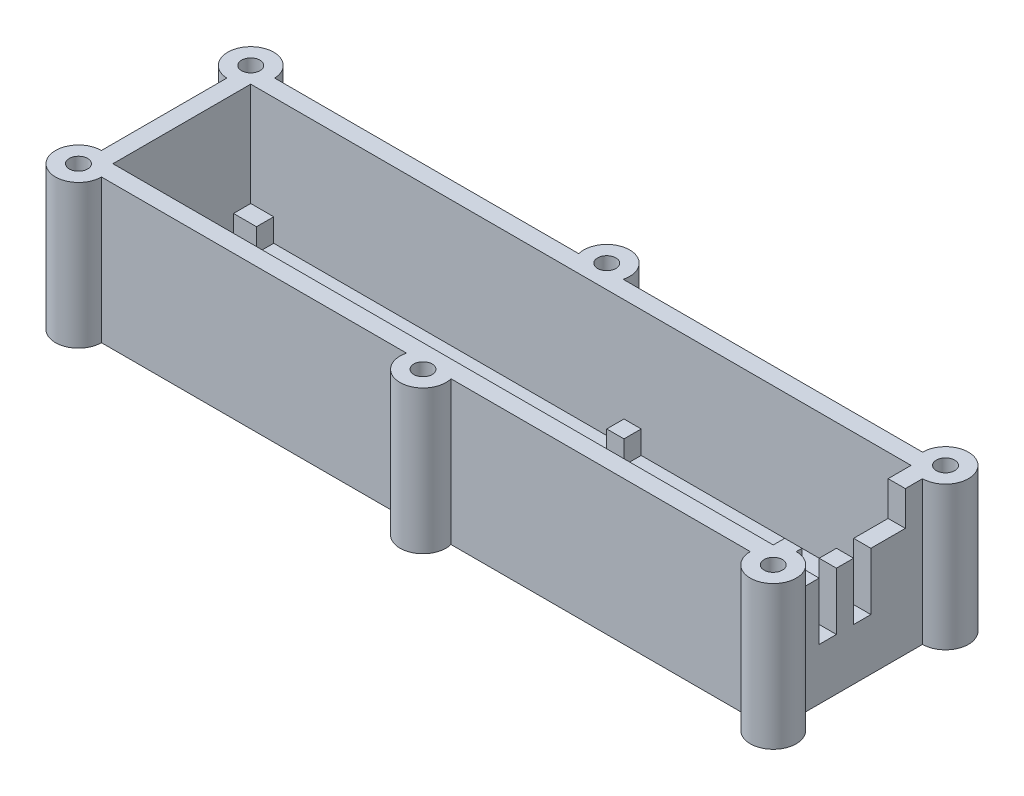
from build123d import *

# Parameters (mm, degrees)
SKETCH_1_W           = 121
SKETCH_1_H           = 30
EXTRUDE_1_DEPTH      = 25
SKETCH_3_W           = 115
SKETCH_3_H           = 24
CUT_EXTRUDE_1_DEPTH  = 22
SKETCH_14_R          = 4
EXTRUDE_4_DEPTH      = 25
SKETCH_15_R          = 1.6
CUT_EXTRUDE_2_DEPTH  = 129.102937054
CUT_EXTRUDE_5_DEPTH  = 3
SKETCH_13_W          = 3
SKETCH_13_H          = 3
EXTRUDE_5_DEPTH      = 4
SKETCH_8_W           = 2
SKETCH_8_H           = 2
EXTRUDE_6_DEPTH      = 4
SKETCH_12_W          = 4
SKETCH_12_H          = 3
EXTRUDE_7_DEPTH      = 4
SKETCH_9_W           = 2
SKETCH_9_H           = 2
EXTRUDE_8_DEPTH      = 4
SKETCH_27_R          = 4
EXTRUDE_12_DEPTH     = 25
SKETCH_27_6_R        = 1.6
CUT_EXTRUDE_7_DEPTH  = 133.193040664
SKETCH_31_R          = 1.6
CUT_EXTRUDE_8_DEPTH  = 133.193040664
CUT_EXTRUDE_START    = -3
SKETCH_32_R          = 1.6
CUT_EXTRUDE_9_DEPTH  = 3
SKETCH_37_W          = 3
SKETCH_37_H          = 16
CUT_EXTRUDE_10_DEPTH = 3
SKETCH_41_W          = 18
SKETCH_41_H          = 6
CUT_EXTRUDE_11_DEPTH = 3


with BuildPart() as part:
    # Sketch 1 → Extrude 1 (new body)
    with BuildSketch(Plane(origin=(0, 0, 0), x_dir=(1, 0, 0), z_dir=(0, 1, 0))):
        with Locations((60.5, 15)):
            Rectangle(SKETCH_1_W, SKETCH_1_H)
    extrude(amount=EXTRUDE_1_DEPTH)

    # Sketch 3 → Cut-Extrude 1 (cut)
    with BuildSketch(Plane(origin=(0, 25, 0), x_dir=(1, 0, 0), z_dir=(0, 1, 0))):
        with Locations((60.5, 15)):
            Rectangle(SKETCH_3_W, SKETCH_3_H)
    extrude(amount=-CUT_EXTRUDE_1_DEPTH, mode=Mode.SUBTRACT)

    # Sketch 14 → Extrude 4 (add)
    with BuildSketch(Plane(origin=(0, 25, 0), x_dir=(1, 0, 0), z_dir=(0, 1, 0))):
        with Locations((0.171572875, 29.828427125)):
            Circle(SKETCH_14_R)
    extrude(amount=-EXTRUDE_4_DEPTH)

    # Sketch 15 → Cut-Extrude 2 (cut, through all)
    with BuildSketch(Plane(origin=(0, 25, 0), x_dir=(1, 0, 0), z_dir=(0, 1, 0))):
        with Locations(Location((0.171572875, 29.828427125, 0), (0, 0, 270))):
            Circle(SKETCH_15_R)
    extrude(amount=-CUT_EXTRUDE_2_DEPTH, mode=Mode.SUBTRACT)

    # Sketch 17 → Cut-Extrude 5 (cut)
    with BuildSketch(Plane.XZ):
        Polygon((-3.003853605, -29.828427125), (-1.416140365, -32.578427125), (1.759286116, -32.578427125), (3.346999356, -29.828427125), (1.759286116, -27.078427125), (-1.416140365, -27.078427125), align=None)
    extrude(amount=-CUT_EXTRUDE_5_DEPTH, mode=Mode.SUBTRACT)

    # Sketch 13 → Extrude 5 (add)
    with BuildSketch(Plane(origin=(0, 3, 0), x_dir=(1, 0, 0), z_dir=(0, 1, 0))):
        with Locations((69.5, 25.5)):
            Rectangle(SKETCH_13_W, SKETCH_13_H)
        with Locations((69.5, 4.5)):
            Rectangle(SKETCH_13_W, SKETCH_13_H)
    extrude(amount=EXTRUDE_5_DEPTH)

    # Sketch 8 → Extrude 6 (add)
    with BuildSketch(Plane(origin=(0, 3, 0), x_dir=(1, 0, 0), z_dir=(0, 1, 0))):
        with Locations((117, 26)):
            Rectangle(SKETCH_8_W, SKETCH_8_H)
    extrude(amount=EXTRUDE_6_DEPTH)

    # Sketch 12 → Extrude 7 (add)
    with BuildSketch(Plane(origin=(0, 3, 0), x_dir=(1, 0, 0), z_dir=(0, 1, 0))):
        with Locations((5, 4.5)):
            Rectangle(SKETCH_12_W, SKETCH_12_H)
        with Locations((5, 25.5)):
            Rectangle(SKETCH_12_W, SKETCH_12_H)
    extrude(amount=EXTRUDE_7_DEPTH)

    # Sketch 9 → Extrude 8 (add)
    with BuildSketch(Plane(origin=(0, 3, 0), x_dir=(1, 0, 0), z_dir=(0, 1, 0))):
        with Locations((117, 4)):
            Rectangle(SKETCH_9_W, SKETCH_9_H)
    extrude(amount=EXTRUDE_8_DEPTH)

    # Sketch 27 → Extrude 12 (add)
    with BuildSketch(Plane(origin=(0, 25, 0), x_dir=(1, 0, 0), z_dir=(0, 1, 0))):
        Circle(SKETCH_27_R)
        with Locations((61, -1)):
            Circle(SKETCH_27_R)
        with Locations((61, 31)):
            Circle(SKETCH_27_R)
        with Locations((121, 0)):
            Circle(SKETCH_27_R)
        with Locations((121, 30)):
            Circle(SKETCH_27_R)
    extrude(amount=-EXTRUDE_12_DEPTH)

    # Sketch 27_6 → Cut-Extrude 7 (cut, through all)
    with BuildSketch(Plane(origin=(0, 25, 0), x_dir=(1, 0, 0), z_dir=(0, 1, 0))):
        with Locations(Location((61, 31, 0), (0, 0, 270))):
            Circle(SKETCH_27_6_R)
        with Locations(Location((121, 30, 0), (0, 0, 270))):
            Circle(SKETCH_27_6_R)
        with Locations(Location((121, 0, 0), (0, 0, 270))):
            Circle(SKETCH_27_6_R)
        with Locations(Location((61, -1, 0), (0, 0, 270))):
            Circle(SKETCH_27_6_R)
    extrude(amount=-CUT_EXTRUDE_7_DEPTH, mode=Mode.SUBTRACT)

    # Sketch 31 → Cut-Extrude 8 (cut, through all)
    with BuildSketch(Plane(origin=(0, 25, 0), x_dir=(1, 0, 0), z_dir=(0, 1, 0))):
        with Locations(Location((0, 0, 0), (0, 0, 270))):
            Circle(SKETCH_31_R)
    extrude(amount=-CUT_EXTRUDE_8_DEPTH, mode=Mode.SUBTRACT)

    # Sketch 32 → Cut-Extrude 9 (cut)
    # profile 1 of 5: a face of its own
    with BuildSketch(Plane.XZ.offset(CUT_EXTRUDE_START)):
        Polygon((57.824573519, 1), (59.41228676, -1.75), (62.58771324, -1.75), (64.175426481, 1), (62.58771324, 3.75), (59.41228676, 3.75), align=None)
        with Locations(Location((61, 1, 0), (0, 0, 90))):
            Circle(SKETCH_32_R, mode=Mode.SUBTRACT)
    # profile 2 of 5: a face of its own
    with BuildSketch(Plane.XZ.offset(CUT_EXTRUDE_START)):
        Polygon((117.824573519, 0), (119.41228676, -2.75), (122.58771324, -2.75), (124.175426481, 0), (122.58771324, 2.75), (119.41228676, 2.75), align=None)
        with Locations(Location((121, 0, 0), (0, 0, 90))):
            Circle(SKETCH_32_R, mode=Mode.SUBTRACT)
    # profile 3 of 5: a face of its own
    with BuildSketch(Plane.XZ.offset(CUT_EXTRUDE_START)):
        Polygon((117.824573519, -30), (119.41228676, -32.75), (122.58771324, -32.75), (124.175426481, -30), (122.58771324, -27.25), (119.41228676, -27.25), align=None)
        with Locations(Location((121, -30, 0), (0, 0, 90))):
            Circle(SKETCH_32_R, mode=Mode.SUBTRACT)
    # profile 4 of 5: a face of its own
    with BuildSketch(Plane.XZ.offset(CUT_EXTRUDE_START)):
        Polygon((62.58771324, -33.75), (64.175426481, -31), (62.58771324, -28.25), (59.41228676, -28.25), (57.824573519, -31), (59.41228676, -33.75), align=None)
        with Locations(Location((61, -31, 0), (0, 0, 90))):
            Circle(SKETCH_32_R, mode=Mode.SUBTRACT)
    # profile 5 of 5: a face of its own
    with BuildSketch(Plane.XZ.offset(CUT_EXTRUDE_START)):
        Polygon((1.58771324, -2.75), (3.175426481, 0), (1.58771324, 2.75), (-1.58771324, 2.75), (-3.175426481, 0), (-1.58771324, -2.75), align=None)
    extrude(amount=CUT_EXTRUDE_9_DEPTH, mode=Mode.SUBTRACT)

    # Sketch 37 → Cut-Extrude 10 (cut)
    with BuildSketch(Plane(origin=(121, 0, 0), x_dir=(0, 0, -1), z_dir=(1, 0, 0))):
        with Locations((15.5, 17)):
            Rectangle(SKETCH_37_W, SKETCH_37_H)
        with Locations((9.5, 17)):
            Rectangle(SKETCH_37_W, SKETCH_37_H)
    extrude(amount=-CUT_EXTRUDE_10_DEPTH, mode=Mode.SUBTRACT)

    # Sketch 41 → Cut-Extrude 11 (cut)
    with BuildSketch(Plane(origin=(121, 0, 0), x_dir=(0, 0, -1), z_dir=(1, 0, 0))):
        with Locations((14, 22)):
            Rectangle(SKETCH_41_W, SKETCH_41_H)
    extrude(amount=-CUT_EXTRUDE_11_DEPTH, mode=Mode.SUBTRACT)


solid = part.part
